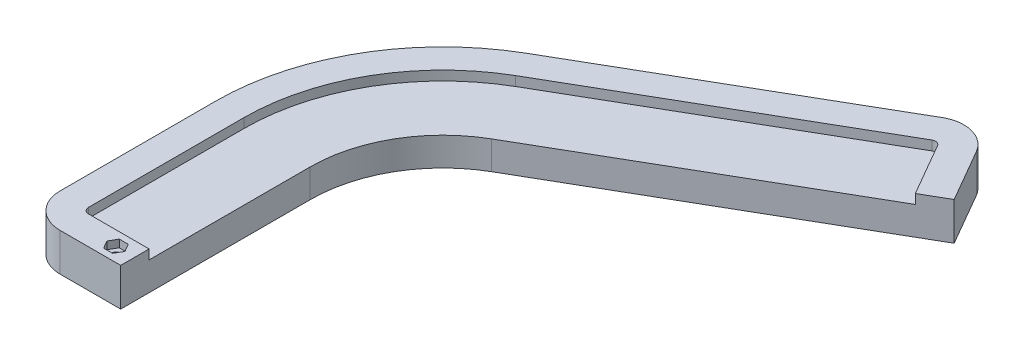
ISO-10303-21;
HEADER;
FILE_DESCRIPTION(('STEP AP214'),'2;1');
FILE_NAME('part.step','',(''),(''),'','','');
FILE_SCHEMA(('AUTOMOTIVE_DESIGN { 1 0 10303 214 1 1 1 1 }'));
ENDSEC;
DATA;
#1=APPLICATION_CONTEXT('core data for automotive mechanical design processes');
#2=APPLICATION_PROTOCOL_DEFINITION('international standard','automotive_design',2000,#1);
#3=PRODUCT_CONTEXT('',#1,'mechanical');
#4=PRODUCT('Part','Part','',(#3));
#5=PRODUCT_RELATED_PRODUCT_CATEGORY('part','',(#4));
#6=PRODUCT_DEFINITION_FORMATION('','',#4);
#7=PRODUCT_DEFINITION_CONTEXT('part definition',#1,'design');
#8=PRODUCT_DEFINITION('design','',#6,#7);
#9=PRODUCT_DEFINITION_SHAPE('','',#8);
#10=(LENGTH_UNIT() NAMED_UNIT(*) SI_UNIT(.MILLI.,.METRE.));
#11=(NAMED_UNIT(*) PLANE_ANGLE_UNIT() SI_UNIT($,.RADIAN.));
#12=(NAMED_UNIT(*) SI_UNIT($,.STERADIAN.) SOLID_ANGLE_UNIT());
#13=UNCERTAINTY_MEASURE_WITH_UNIT(LENGTH_MEASURE(1.E-05),#10,'distance_accuracy_value','');
#14=(GEOMETRIC_REPRESENTATION_CONTEXT(3) GLOBAL_UNCERTAINTY_ASSIGNED_CONTEXT((#13)) GLOBAL_UNIT_ASSIGNED_CONTEXT((#10,
#11,#12)) REPRESENTATION_CONTEXT('',''));
#15=CARTESIAN_POINT('',(0.,0.,0.));
#16=DIRECTION('',(0.,0.,1.));
#17=DIRECTION('',(1.,0.,0.));
#18=AXIS2_PLACEMENT_3D('',#15,#16,#17);
#19=CARTESIAN_POINT('',(0.,20.,0.));
#20=DIRECTION('',(-1.,0.,0.));
#21=DIRECTION('',(0.,0.,1.));
#22=AXIS2_PLACEMENT_3D('',#19,#20,#21);
#23=PLANE('',#22);
#24=DIRECTION('',(0.,0.,-1.));
#25=VECTOR('',#24,1.);
#26=CARTESIAN_POINT('',(0.,15.,-100.));
#27=LINE('',#26,#25);
#28=CARTESIAN_POINT('',(0.,15.,-15.));
#29=VERTEX_POINT('',#28);
#30=CARTESIAN_POINT('',(0.,15.,-100.));
#31=VERTEX_POINT('',#30);
#32=EDGE_CURVE('E251',#29,#31,#27,.T.);
#33=ORIENTED_EDGE('',*,*,#32,.F.);
#34=DIRECTION('',(0.,-1.,0.));
#35=VECTOR('',#34,1.);
#36=CARTESIAN_POINT('',(0.,20.,-15.));
#37=LINE('',#36,#35);
#38=CARTESIAN_POINT('',(0.,20.,-15.));
#39=VERTEX_POINT('',#38);
#40=EDGE_CURVE('E274',#39,#29,#37,.T.);
#41=ORIENTED_EDGE('',*,*,#40,.F.);
#42=DIRECTION('',(0.,0.,-1.));
#43=VECTOR('',#42,1.);
#44=CARTESIAN_POINT('',(0.,20.,0.));
#45=LINE('',#44,#43);
#46=CARTESIAN_POINT('',(0.,20.,0.));
#47=VERTEX_POINT('',#46);
#48=EDGE_CURVE('E326',#47,#39,#45,.T.);
#49=ORIENTED_EDGE('',*,*,#48,.F.);
#50=DIRECTION('',(0.,-1.,0.));
#51=VECTOR('',#50,1.);
#52=CARTESIAN_POINT('',(0.,20.,0.));
#53=LINE('',#52,#51);
#54=CARTESIAN_POINT('',(0.,0.,0.));
#55=VERTEX_POINT('',#54);
#56=EDGE_CURVE('E354',#47,#55,#53,.T.);
#57=ORIENTED_EDGE('',*,*,#56,.T.);
#58=DIRECTION('',(0.,0.,-1.));
#59=VECTOR('',#58,1.);
#60=CARTESIAN_POINT('',(0.,0.,0.));
#61=LINE('',#60,#59);
#62=CARTESIAN_POINT('',(0.,0.,-100.));
#63=VERTEX_POINT('',#62);
#64=EDGE_CURVE('E306',#55,#63,#61,.T.);
#65=ORIENTED_EDGE('',*,*,#64,.T.);
#66=DIRECTION('',(0.,-1.,0.));
#67=VECTOR('',#66,1.);
#68=CARTESIAN_POINT('',(0.,20.,-100.));
#69=LINE('',#68,#67);
#70=EDGE_CURVE('E352',#31,#63,#69,.T.);
#71=ORIENTED_EDGE('',*,*,#70,.F.);
#72=EDGE_LOOP('',(#33,#41,#49,#57,#65,#71));
#73=FACE_BOUND('',#72,.T.);
#74=ADVANCED_FACE('F28',(#73),#23,.F.);
#75=CARTESIAN_POINT('',(70.,20.,-100.));
#76=DIRECTION('',(0.,-1.,0.));
#77=DIRECTION('',(0.,0.,-1.));
#78=AXIS2_PLACEMENT_3D('',#75,#76,#77);
#79=CYLINDRICAL_SURFACE('',#78,70.);
#80=CARTESIAN_POINT('',(70.,15.,-100.));
#81=DIRECTION('',(0.,-1.,0.));
#82=DIRECTION('',(0.,0.,-1.));
#83=AXIS2_PLACEMENT_3D('',#80,#81,#82);
#84=CIRCLE('',#83,70.);
#85=CARTESIAN_POINT('',(35.0000000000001,15.,-160.621778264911));
#86=VERTEX_POINT('',#85);
#87=EDGE_CURVE('E290',#31,#86,#84,.T.);
#88=ORIENTED_EDGE('',*,*,#87,.F.);
#89=ORIENTED_EDGE('',*,*,#70,.T.);
#90=CARTESIAN_POINT('',(70.,0.,-100.));
#91=DIRECTION('',(0.,-1.,0.));
#92=DIRECTION('',(0.,0.,-1.));
#93=AXIS2_PLACEMENT_3D('',#90,#91,#92);
#94=CIRCLE('',#93,70.);
#95=CARTESIAN_POINT('',(35.0000000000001,0.,-160.621778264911));
#96=VERTEX_POINT('',#95);
#97=EDGE_CURVE('E309',#63,#96,#94,.T.);
#98=ORIENTED_EDGE('',*,*,#97,.T.);
#99=DIRECTION('',(0.,-1.,0.));
#100=VECTOR('',#99,1.);
#101=CARTESIAN_POINT('',(35.0000000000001,20.,-160.621778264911));
#102=LINE('',#101,#100);
#103=EDGE_CURVE('E350',#86,#96,#102,.T.);
#104=ORIENTED_EDGE('',*,*,#103,.F.);
#105=EDGE_LOOP('',(#88,#89,#98,#104));
#106=FACE_BOUND('',#105,.T.);
#107=ADVANCED_FACE('F423',(#106),#79,.F.);
#108=CARTESIAN_POINT('',(35.0000000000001,20.,-160.621778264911));
#109=DIRECTION('',(-0.499999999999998,0.,-0.86602540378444));
#110=DIRECTION('',(-0.86602540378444,0.,0.499999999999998));
#111=AXIS2_PLACEMENT_3D('',#108,#109,#110);
#112=PLANE('',#111);
#113=DIRECTION('',(0.86602540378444,0.,-0.499999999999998));
#114=VECTOR('',#113,1.);
#115=CARTESIAN_POINT('',(35.0000000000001,15.,-160.621778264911));
#116=LINE('',#115,#114);
#117=CARTESIAN_POINT('',(176.817240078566,15.,-242.5));
#118=VERTEX_POINT('',#117);
#119=EDGE_CURVE('E262',#86,#118,#116,.T.);
#120=ORIENTED_EDGE('',*,*,#119,.F.);
#121=ORIENTED_EDGE('',*,*,#103,.T.);
#122=DIRECTION('',(0.86602540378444,0.,-0.499999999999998));
#123=VECTOR('',#122,1.);
#124=CARTESIAN_POINT('',(35.0000000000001,0.,-160.621778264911));
#125=LINE('',#124,#123);
#126=CARTESIAN_POINT('',(189.807621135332,0.,-250.));
#127=VERTEX_POINT('',#126);
#128=EDGE_CURVE('E312',#96,#127,#125,.T.);
#129=ORIENTED_EDGE('',*,*,#128,.T.);
#130=DIRECTION('',(0.,-1.,0.));
#131=VECTOR('',#130,1.);
#132=CARTESIAN_POINT('',(189.807621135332,20.,-250.));
#133=LINE('',#132,#131);
#134=CARTESIAN_POINT('',(189.807621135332,20.,-250.));
#135=VERTEX_POINT('',#134);
#136=EDGE_CURVE('E347',#135,#127,#133,.T.);
#137=ORIENTED_EDGE('',*,*,#136,.F.);
#138=DIRECTION('',(0.86602540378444,0.,-0.499999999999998));
#139=VECTOR('',#138,1.);
#140=CARTESIAN_POINT('',(35.0000000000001,20.,-160.621778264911));
#141=LINE('',#140,#139);
#142=CARTESIAN_POINT('',(176.817240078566,20.,-242.5));
#143=VERTEX_POINT('',#142);
#144=EDGE_CURVE('E329',#143,#135,#141,.T.);
#145=ORIENTED_EDGE('',*,*,#144,.F.);
#146=DIRECTION('',(0.,-1.,0.));
#147=VECTOR('',#146,1.);
#148=CARTESIAN_POINT('',(176.817240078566,20.,-242.5));
#149=LINE('',#148,#147);
#150=EDGE_CURVE('E278',#143,#118,#149,.T.);
#151=ORIENTED_EDGE('',*,*,#150,.T.);
#152=EDGE_LOOP('',(#120,#121,#129,#137,#145,#151));
#153=FACE_BOUND('',#152,.T.);
#154=ADVANCED_FACE('F419',(#153),#112,.F.);
#155=CARTESIAN_POINT('',(70.,20.,-100.));
#156=DIRECTION('',(0.,-1.,0.));
#157=DIRECTION('',(0.,0.,-1.));
#158=AXIS2_PLACEMENT_3D('',#155,#156,#157);
#159=PLANE('',#158);
#160=DIRECTION('',(-0.5,0.,0.866025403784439));
#161=VECTOR('',#160,1.);
#162=CARTESIAN_POINT('',(-12.3815698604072,20.0000000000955,-11.625));
#163=LINE('',#162,#161);
#164=CARTESIAN_POINT('',(-12.3815698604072,20.,-11.625));
#165=VERTEX_POINT('',#164);
#166=CARTESIAN_POINT('',(-14.7631397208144,20.0000000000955,-7.49999999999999));
#167=VERTEX_POINT('',#166);
#168=EDGE_CURVE('E204',#165,#167,#163,.T.);
#169=ORIENTED_EDGE('',*,*,#168,.F.);
#170=DIRECTION('',(-1.,0.,0.));
#171=VECTOR('',#170,1.);
#172=CARTESIAN_POINT('',(-7.61843013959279,20.0000000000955,-11.625));
#173=LINE('',#172,#171);
#174=CARTESIAN_POINT('',(-7.61843013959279,20.0000000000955,-11.625));
#175=VERTEX_POINT('',#174);
#176=EDGE_CURVE('E43',#175,#165,#173,.T.);
#177=ORIENTED_EDGE('',*,*,#176,.F.);
#178=DIRECTION('',(-0.5,0.,-0.866025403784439));
#179=VECTOR('',#178,1.);
#180=CARTESIAN_POINT('',(-5.23686027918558,20.0000000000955,-7.49999999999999));
#181=LINE('',#180,#179);
#182=CARTESIAN_POINT('',(-5.23686027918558,20.0000000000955,-7.49999999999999));
#183=VERTEX_POINT('',#182);
#184=EDGE_CURVE('E220',#183,#175,#181,.T.);
#185=ORIENTED_EDGE('',*,*,#184,.F.);
#186=DIRECTION('',(0.5,0.,-0.866025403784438));
#187=VECTOR('',#186,1.);
#188=CARTESIAN_POINT('',(-7.61843013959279,20.0000000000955,-3.37499999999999));
#189=LINE('',#188,#187);
#190=CARTESIAN_POINT('',(-7.61843013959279,20.0000000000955,-3.37499999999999));
#191=VERTEX_POINT('',#190);
#192=EDGE_CURVE('E214',#191,#183,#189,.T.);
#193=ORIENTED_EDGE('',*,*,#192,.F.);
#194=DIRECTION('',(1.,0.,0.));
#195=VECTOR('',#194,1.);
#196=CARTESIAN_POINT('',(-12.3815698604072,20.0000000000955,-3.37499999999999));
#197=LINE('',#196,#195);
#198=CARTESIAN_POINT('',(-12.3815698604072,20.0000000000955,-3.37499999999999));
#199=VERTEX_POINT('',#198);
#200=EDGE_CURVE('E212',#199,#191,#197,.T.);
#201=ORIENTED_EDGE('',*,*,#200,.F.);
#202=DIRECTION('',(0.499999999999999,0.,0.866025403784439));
#203=VECTOR('',#202,1.);
#204=CARTESIAN_POINT('',(-14.7631397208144,20.0000000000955,-7.49999999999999));
#205=LINE('',#204,#203);
#206=EDGE_CURVE('E193',#167,#199,#205,.T.);
#207=ORIENTED_EDGE('',*,*,#206,.F.);
#208=EDGE_LOOP('',(#169,#177,#185,#193,#201,#207));
#209=FACE_BOUND('',#208,.T.);
#210=DIRECTION('',(-0.499999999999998,0.,-0.86602540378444));
#211=VECTOR('',#210,1.);
#212=CARTESIAN_POINT('',(211.817240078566,20.,-181.878221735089));
#213=LINE('',#212,#211);
#214=CARTESIAN_POINT('',(160.817240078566,20.,-270.212812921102));
#215=VERTEX_POINT('',#214);
#216=EDGE_CURVE('E286',#143,#215,#213,.T.);
#217=ORIENTED_EDGE('',*,*,#216,.F.);
#218=ORIENTED_EDGE('',*,*,#144,.T.);
#219=DIRECTION('',(-0.499999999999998,0.,-0.86602540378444));
#220=VECTOR('',#219,1.);
#221=CARTESIAN_POINT('',(164.807621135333,20.,-293.301270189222));
#222=LINE('',#221,#220);
#223=CARTESIAN_POINT('',(173.807621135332,20.,-277.712812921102));
#224=VERTEX_POINT('',#223);
#225=EDGE_CURVE('E331',#135,#224,#222,.T.);
#226=ORIENTED_EDGE('',*,*,#225,.T.);
#227=CARTESIAN_POINT('',(158.219163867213,20.,-268.712812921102));
#228=DIRECTION('',(0.,-1.,0.));
#229=DIRECTION('',(0.,0.,-1.));
#230=AXIS2_PLACEMENT_3D('',#227,#228,#229);
#231=CIRCLE('',#230,18.);
#232=CARTESIAN_POINT('',(149.219163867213,20.,-284.301270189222));
#233=VERTEX_POINT('',#232);
#234=EDGE_CURVE('E368',#224,#233,#231,.F.);
#235=ORIENTED_EDGE('',*,*,#234,.T.);
#236=DIRECTION('',(-0.86602540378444,0.,0.499999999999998));
#237=VECTOR('',#236,1.);
#238=CARTESIAN_POINT('',(10.0000000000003,20.,-203.923048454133));
#239=LINE('',#238,#237);
#240=CARTESIAN_POINT('',(10.0000000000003,20.,-203.923048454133));
#241=VERTEX_POINT('',#240);
#242=EDGE_CURVE('E334',#233,#241,#239,.T.);
#243=ORIENTED_EDGE('',*,*,#242,.T.);
#244=CARTESIAN_POINT('',(70.,20.,-100.));
#245=DIRECTION('',(0.,1.,0.));
#246=DIRECTION('',(0.,0.,-1.));
#247=AXIS2_PLACEMENT_3D('',#244,#245,#246);
#248=CIRCLE('',#247,120.);
#249=CARTESIAN_POINT('',(-50.,20.,-100.));
#250=VERTEX_POINT('',#249);
#251=EDGE_CURVE('E336',#241,#250,#248,.T.);
#252=ORIENTED_EDGE('',*,*,#251,.T.);
#253=DIRECTION('',(0.,0.,1.));
#254=VECTOR('',#253,1.);
#255=CARTESIAN_POINT('',(-50.,20.,0.));
#256=LINE('',#255,#254);
#257=CARTESIAN_POINT('',(-50.,20.,-18.));
#258=VERTEX_POINT('',#257);
#259=EDGE_CURVE('E338',#250,#258,#256,.T.);
#260=ORIENTED_EDGE('',*,*,#259,.T.);
#261=CARTESIAN_POINT('',(-32.,20.,-18.));
#262=DIRECTION('',(0.,-1.,0.));
#263=DIRECTION('',(0.,0.,-1.));
#264=AXIS2_PLACEMENT_3D('',#261,#262,#263);
#265=CIRCLE('',#264,18.);
#266=CARTESIAN_POINT('',(-32.,20.,0.));
#267=VERTEX_POINT('',#266);
#268=EDGE_CURVE('E366',#258,#267,#265,.F.);
#269=ORIENTED_EDGE('',*,*,#268,.T.);
#270=DIRECTION('',(1.,0.,0.));
#271=VECTOR('',#270,1.);
#272=CARTESIAN_POINT('',(-50.,20.,0.));
#273=LINE('',#272,#271);
#274=EDGE_CURVE('E324',#267,#47,#273,.T.);
#275=ORIENTED_EDGE('',*,*,#274,.T.);
#276=ORIENTED_EDGE('',*,*,#48,.T.);
#277=DIRECTION('',(1.,0.,0.));
#278=VECTOR('',#277,1.);
#279=CARTESIAN_POINT('',(70.,20.,-15.));
#280=LINE('',#279,#278);
#281=CARTESIAN_POINT('',(-32.,20.,-15.));
#282=VERTEX_POINT('',#281);
#283=EDGE_CURVE('E268',#282,#39,#280,.T.);
#284=ORIENTED_EDGE('',*,*,#283,.F.);
#285=CARTESIAN_POINT('',(-32.,20.,-18.));
#286=DIRECTION('',(0.,-1.,0.));
#287=DIRECTION('',(0.,0.,-1.));
#288=AXIS2_PLACEMENT_3D('',#285,#286,#287);
#289=CIRCLE('',#288,3.);
#290=CARTESIAN_POINT('',(-35.,20.,-18.));
#291=VERTEX_POINT('',#290);
#292=EDGE_CURVE('E271',#291,#282,#289,.F.);
#293=ORIENTED_EDGE('',*,*,#292,.F.);
#294=DIRECTION('',(0.,0.,1.));
#295=VECTOR('',#294,1.);
#296=CARTESIAN_POINT('',(-35.,20.,-100.));
#297=LINE('',#296,#295);
#298=CARTESIAN_POINT('',(-35.,20.,-100.));
#299=VERTEX_POINT('',#298);
#300=EDGE_CURVE('E282',#299,#291,#297,.T.);
#301=ORIENTED_EDGE('',*,*,#300,.F.);
#302=CARTESIAN_POINT('',(70.,20.,-100.));
#303=DIRECTION('',(0.,-1.,0.));
#304=DIRECTION('',(0.,0.,-1.));
#305=AXIS2_PLACEMENT_3D('',#302,#303,#304);
#306=CIRCLE('',#305,105.);
#307=CARTESIAN_POINT('',(17.5000000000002,20.,-190.932667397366));
#308=VERTEX_POINT('',#307);
#309=EDGE_CURVE('E300',#308,#299,#306,.F.);
#310=ORIENTED_EDGE('',*,*,#309,.F.);
#311=DIRECTION('',(-0.86602540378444,0.,0.499999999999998));
#312=VECTOR('',#311,1.);
#313=CARTESIAN_POINT('',(17.5000000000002,20.,-190.932667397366));
#314=LINE('',#313,#312);
#315=CARTESIAN_POINT('',(156.719163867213,20.,-271.310889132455));
#316=VERTEX_POINT('',#315);
#317=EDGE_CURVE('E297',#316,#308,#314,.T.);
#318=ORIENTED_EDGE('',*,*,#317,.F.);
#319=CARTESIAN_POINT('',(158.219163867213,20.,-268.712812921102));
#320=DIRECTION('',(0.,-1.,0.));
#321=DIRECTION('',(0.,0.,-1.));
#322=AXIS2_PLACEMENT_3D('',#319,#320,#321);
#323=CIRCLE('',#322,3.);
#324=EDGE_CURVE('E249',#215,#316,#323,.F.);
#325=ORIENTED_EDGE('',*,*,#324,.F.);
#326=EDGE_LOOP('',(#217,#218,#226,#235,#243,#252,#260,#269,#275,#276,#284,#293,#301,#310,#318,#325));
#327=FACE_BOUND('',#326,.T.);
#328=ADVANCED_FACE('F208',(#209,#327),#159,.F.);
#329=CARTESIAN_POINT('',(-50.,20.,0.));
#330=DIRECTION('',(0.,0.,-1.));
#331=DIRECTION('',(-1.,0.,0.));
#332=AXIS2_PLACEMENT_3D('',#329,#330,#331);
#333=PLANE('',#332);
#334=ORIENTED_EDGE('',*,*,#274,.F.);
#335=DIRECTION('',(0.,-1.,0.));
#336=VECTOR('',#335,1.);
#337=CARTESIAN_POINT('',(-32.,20.,0.));
#338=LINE('',#337,#336);
#339=CARTESIAN_POINT('',(-32.,0.,0.));
#340=VERTEX_POINT('',#339);
#341=EDGE_CURVE('E36',#267,#340,#338,.T.);
#342=ORIENTED_EDGE('',*,*,#341,.T.);
#343=DIRECTION('',(1.,0.,0.));
#344=VECTOR('',#343,1.);
#345=CARTESIAN_POINT('',(-50.,0.,0.));
#346=LINE('',#345,#344);
#347=EDGE_CURVE('E284',#340,#55,#346,.T.);
#348=ORIENTED_EDGE('',*,*,#347,.T.);
#349=ORIENTED_EDGE('',*,*,#56,.F.);
#350=EDGE_LOOP('',(#334,#342,#348,#349));
#351=FACE_BOUND('',#350,.T.);
#352=ADVANCED_FACE('F30',(#351),#333,.F.);
#353=CARTESIAN_POINT('',(164.807621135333,20.,-293.301270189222));
#354=DIRECTION('',(-0.86602540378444,0.,0.499999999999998));
#355=DIRECTION('',(0.499999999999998,0.,0.86602540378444));
#356=AXIS2_PLACEMENT_3D('',#353,#354,#355);
#357=PLANE('',#356);
#358=DIRECTION('',(-0.499999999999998,0.,-0.86602540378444));
#359=VECTOR('',#358,1.);
#360=CARTESIAN_POINT('',(164.807621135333,0.,-293.301270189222));
#361=LINE('',#360,#359);
#362=CARTESIAN_POINT('',(173.807621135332,0.,-277.712812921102));
#363=VERTEX_POINT('',#362);
#364=EDGE_CURVE('E314',#127,#363,#361,.T.);
#365=ORIENTED_EDGE('',*,*,#364,.T.);
#366=DIRECTION('',(0.,-1.,0.));
#367=VECTOR('',#366,1.);
#368=CARTESIAN_POINT('',(173.807621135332,20.,-277.712812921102));
#369=LINE('',#368,#367);
#370=EDGE_CURVE('E364',#363,#224,#369,.F.);
#371=ORIENTED_EDGE('',*,*,#370,.T.);
#372=ORIENTED_EDGE('',*,*,#225,.F.);
#373=ORIENTED_EDGE('',*,*,#136,.T.);
#374=EDGE_LOOP('',(#365,#371,#372,#373));
#375=FACE_BOUND('',#374,.T.);
#376=ADVANCED_FACE('F413',(#375),#357,.F.);
#377=CARTESIAN_POINT('',(10.0000000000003,20.,-203.923048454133));
#378=DIRECTION('',(0.499999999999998,0.,0.86602540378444));
#379=DIRECTION('',(0.86602540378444,0.,-0.499999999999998));
#380=AXIS2_PLACEMENT_3D('',#377,#378,#379);
#381=PLANE('',#380);
#382=ORIENTED_EDGE('',*,*,#242,.F.);
#383=DIRECTION('',(0.,-1.,0.));
#384=VECTOR('',#383,1.);
#385=CARTESIAN_POINT('',(149.219163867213,20.,-284.301270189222));
#386=LINE('',#385,#384);
#387=CARTESIAN_POINT('',(149.219163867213,0.,-284.301270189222));
#388=VERTEX_POINT('',#387);
#389=EDGE_CURVE('E357',#233,#388,#386,.T.);
#390=ORIENTED_EDGE('',*,*,#389,.T.);
#391=DIRECTION('',(-0.86602540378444,0.,0.499999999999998));
#392=VECTOR('',#391,1.);
#393=CARTESIAN_POINT('',(10.0000000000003,0.,-203.923048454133));
#394=LINE('',#393,#392);
#395=CARTESIAN_POINT('',(10.0000000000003,0.,-203.923048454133));
#396=VERTEX_POINT('',#395);
#397=EDGE_CURVE('E317',#388,#396,#394,.T.);
#398=ORIENTED_EDGE('',*,*,#397,.T.);
#399=DIRECTION('',(0.,-1.,0.));
#400=VECTOR('',#399,1.);
#401=CARTESIAN_POINT('',(10.0000000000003,20.,-203.923048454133));
#402=LINE('',#401,#400);
#403=EDGE_CURVE('E344',#241,#396,#402,.T.);
#404=ORIENTED_EDGE('',*,*,#403,.F.);
#405=EDGE_LOOP('',(#382,#390,#398,#404));
#406=FACE_BOUND('',#405,.T.);
#407=ADVANCED_FACE('F405',(#406),#381,.F.);
#408=CARTESIAN_POINT('',(70.,20.,-100.));
#409=DIRECTION('',(0.,-1.,0.));
#410=DIRECTION('',(0.,0.,-1.));
#411=AXIS2_PLACEMENT_3D('',#408,#409,#410);
#412=CYLINDRICAL_SURFACE('',#411,120.);
#413=CARTESIAN_POINT('',(70.,0.,-100.));
#414=DIRECTION('',(0.,1.,0.));
#415=DIRECTION('',(0.,0.,-1.));
#416=AXIS2_PLACEMENT_3D('',#413,#414,#415);
#417=CIRCLE('',#416,120.);
#418=CARTESIAN_POINT('',(-50.,0.,-100.));
#419=VERTEX_POINT('',#418);
#420=EDGE_CURVE('E319',#396,#419,#417,.T.);
#421=ORIENTED_EDGE('',*,*,#420,.T.);
#422=DIRECTION('',(0.,-1.,0.));
#423=VECTOR('',#422,1.);
#424=CARTESIAN_POINT('',(-50.,20.,-100.));
#425=LINE('',#424,#423);
#426=EDGE_CURVE('E341',#250,#419,#425,.T.);
#427=ORIENTED_EDGE('',*,*,#426,.F.);
#428=ORIENTED_EDGE('',*,*,#251,.F.);
#429=ORIENTED_EDGE('',*,*,#403,.T.);
#430=EDGE_LOOP('',(#421,#427,#428,#429));
#431=FACE_BOUND('',#430,.T.);
#432=ADVANCED_FACE('F400',(#431),#412,.T.);
#433=CARTESIAN_POINT('',(-50.,20.,0.));
#434=DIRECTION('',(1.,0.,0.));
#435=DIRECTION('',(0.,0.,-1.));
#436=AXIS2_PLACEMENT_3D('',#433,#434,#435);
#437=PLANE('',#436);
#438=DIRECTION('',(0.,0.,1.));
#439=VECTOR('',#438,1.);
#440=CARTESIAN_POINT('',(-50.,0.,0.));
#441=LINE('',#440,#439);
#442=CARTESIAN_POINT('',(-50.,0.,-18.));
#443=VERTEX_POINT('',#442);
#444=EDGE_CURVE('E321',#419,#443,#441,.T.);
#445=ORIENTED_EDGE('',*,*,#444,.T.);
#446=DIRECTION('',(0.,-1.,0.));
#447=VECTOR('',#446,1.);
#448=CARTESIAN_POINT('',(-50.,20.,-18.));
#449=LINE('',#448,#447);
#450=EDGE_CURVE('E11',#443,#258,#449,.F.);
#451=ORIENTED_EDGE('',*,*,#450,.T.);
#452=ORIENTED_EDGE('',*,*,#259,.F.);
#453=ORIENTED_EDGE('',*,*,#426,.T.);
#454=EDGE_LOOP('',(#445,#451,#452,#453));
#455=FACE_BOUND('',#454,.T.);
#456=ADVANCED_FACE('F396',(#455),#437,.F.);
#457=CARTESIAN_POINT('',(70.,0.,-100.));
#458=DIRECTION('',(0.,-1.,0.));
#459=DIRECTION('',(0.,0.,-1.));
#460=AXIS2_PLACEMENT_3D('',#457,#458,#459);
#461=PLANE('',#460);
#462=CARTESIAN_POINT('',(-9.99999999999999,0.,-7.5));
#463=DIRECTION('',(0.,1.,0.));
#464=DIRECTION('',(0.,0.,1.));
#465=AXIS2_PLACEMENT_3D('',#462,#463,#464);
#466=CIRCLE('',#465,2.00000000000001);
#467=CARTESIAN_POINT('',(-9.99999999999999,0.,-5.49999999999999));
#468=VERTEX_POINT('',#467);
#469=EDGE_CURVE('E594',#468,#468,#466,.T.);
#470=ORIENTED_EDGE('',*,*,#469,.T.);
#471=EDGE_LOOP('',(#470));
#472=FACE_BOUND('',#471,.T.);
#473=ORIENTED_EDGE('',*,*,#397,.F.);
#474=CARTESIAN_POINT('',(158.219163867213,0.,-268.712812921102));
#475=DIRECTION('',(0.,-1.,0.));
#476=DIRECTION('',(0.,0.,-1.));
#477=AXIS2_PLACEMENT_3D('',#474,#475,#476);
#478=CIRCLE('',#477,18.);
#479=EDGE_CURVE('E362',#388,#363,#478,.T.);
#480=ORIENTED_EDGE('',*,*,#479,.T.);
#481=ORIENTED_EDGE('',*,*,#364,.F.);
#482=ORIENTED_EDGE('',*,*,#128,.F.);
#483=ORIENTED_EDGE('',*,*,#97,.F.);
#484=ORIENTED_EDGE('',*,*,#64,.F.);
#485=ORIENTED_EDGE('',*,*,#347,.F.);
#486=CARTESIAN_POINT('',(-32.,0.,-18.));
#487=DIRECTION('',(0.,-1.,0.));
#488=DIRECTION('',(0.,0.,-1.));
#489=AXIS2_PLACEMENT_3D('',#486,#487,#488);
#490=CIRCLE('',#489,18.);
#491=EDGE_CURVE('E360',#340,#443,#490,.T.);
#492=ORIENTED_EDGE('',*,*,#491,.T.);
#493=ORIENTED_EDGE('',*,*,#444,.F.);
#494=ORIENTED_EDGE('',*,*,#420,.F.);
#495=EDGE_LOOP('',(#473,#480,#481,#482,#483,#484,#485,#492,#493,#494));
#496=FACE_BOUND('',#495,.T.);
#497=ADVANCED_FACE('F380',(#472,#496),#461,.T.);
#498=CARTESIAN_POINT('',(158.219163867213,20.,-268.712812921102));
#499=DIRECTION('',(0.,-1.,0.));
#500=DIRECTION('',(0.,0.,-1.));
#501=AXIS2_PLACEMENT_3D('',#498,#499,#500);
#502=CYLINDRICAL_SURFACE('',#501,18.);
#503=ORIENTED_EDGE('',*,*,#234,.F.);
#504=ORIENTED_EDGE('',*,*,#370,.F.);
#505=ORIENTED_EDGE('',*,*,#479,.F.);
#506=ORIENTED_EDGE('',*,*,#389,.F.);
#507=EDGE_LOOP('',(#503,#504,#505,#506));
#508=FACE_BOUND('',#507,.T.);
#509=ADVANCED_FACE('F409',(#508),#502,.T.);
#510=CARTESIAN_POINT('',(-32.,20.,-18.));
#511=DIRECTION('',(0.,-1.,0.));
#512=DIRECTION('',(0.,0.,-1.));
#513=AXIS2_PLACEMENT_3D('',#510,#511,#512);
#514=CYLINDRICAL_SURFACE('',#513,18.);
#515=ORIENTED_EDGE('',*,*,#268,.F.);
#516=ORIENTED_EDGE('',*,*,#450,.F.);
#517=ORIENTED_EDGE('',*,*,#491,.F.);
#518=ORIENTED_EDGE('',*,*,#341,.F.);
#519=EDGE_LOOP('',(#515,#516,#517,#518));
#520=FACE_BOUND('',#519,.T.);
#521=ADVANCED_FACE('F394',(#520),#514,.T.);
#522=CARTESIAN_POINT('',(-50.,20.,-15.));
#523=DIRECTION('',(0.,0.,-1.));
#524=DIRECTION('',(-1.,0.,0.));
#525=AXIS2_PLACEMENT_3D('',#522,#523,#524);
#526=PLANE('',#525);
#527=ORIENTED_EDGE('',*,*,#283,.T.);
#528=ORIENTED_EDGE('',*,*,#40,.T.);
#529=DIRECTION('',(1.,0.,0.));
#530=VECTOR('',#529,1.);
#531=CARTESIAN_POINT('',(70.,15.,-15.));
#532=LINE('',#531,#530);
#533=CARTESIAN_POINT('',(-32.,15.,-15.));
#534=VERTEX_POINT('',#533);
#535=EDGE_CURVE('E240',#534,#29,#532,.T.);
#536=ORIENTED_EDGE('',*,*,#535,.F.);
#537=DIRECTION('',(0.,1.,0.));
#538=VECTOR('',#537,1.);
#539=CARTESIAN_POINT('',(-32.,20.,-15.));
#540=LINE('',#539,#538);
#541=EDGE_CURVE('E51',#282,#534,#540,.F.);
#542=ORIENTED_EDGE('',*,*,#541,.F.);
#543=EDGE_LOOP('',(#527,#528,#536,#542));
#544=FACE_BOUND('',#543,.T.);
#545=ADVANCED_FACE('F426',(#544),#526,.T.);
#546=CARTESIAN_POINT('',(151.817240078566,20.,-285.801270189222));
#547=DIRECTION('',(-0.86602540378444,0.,0.499999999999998));
#548=DIRECTION('',(0.499999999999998,0.,0.86602540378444));
#549=AXIS2_PLACEMENT_3D('',#546,#547,#548);
#550=PLANE('',#549);
#551=DIRECTION('',(-0.499999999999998,0.,-0.86602540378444));
#552=VECTOR('',#551,1.);
#553=CARTESIAN_POINT('',(211.817240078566,15.,-181.878221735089));
#554=LINE('',#553,#552);
#555=CARTESIAN_POINT('',(160.817240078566,15.,-270.212812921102));
#556=VERTEX_POINT('',#555);
#557=EDGE_CURVE('E255',#118,#556,#554,.T.);
#558=ORIENTED_EDGE('',*,*,#557,.F.);
#559=ORIENTED_EDGE('',*,*,#150,.F.);
#560=ORIENTED_EDGE('',*,*,#216,.T.);
#561=DIRECTION('',(0.,1.,0.));
#562=VECTOR('',#561,1.);
#563=CARTESIAN_POINT('',(160.817240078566,20.,-270.212812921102));
#564=LINE('',#563,#562);
#565=EDGE_CURVE('E258',#556,#215,#564,.T.);
#566=ORIENTED_EDGE('',*,*,#565,.F.);
#567=EDGE_LOOP('',(#558,#559,#560,#566));
#568=FACE_BOUND('',#567,.T.);
#569=ADVANCED_FACE('F428',(#568),#550,.T.);
#570=CARTESIAN_POINT('',(17.5000000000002,20.,-190.932667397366));
#571=DIRECTION('',(0.499999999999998,0.,0.86602540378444));
#572=DIRECTION('',(0.86602540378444,0.,-0.499999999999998));
#573=AXIS2_PLACEMENT_3D('',#570,#571,#572);
#574=PLANE('',#573);
#575=ORIENTED_EDGE('',*,*,#317,.T.);
#576=DIRECTION('',(0.,-1.,0.));
#577=VECTOR('',#576,1.);
#578=CARTESIAN_POINT('',(17.5000000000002,20.,-190.932667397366));
#579=LINE('',#578,#577);
#580=CARTESIAN_POINT('',(17.5000000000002,15.,-190.932667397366));
#581=VERTEX_POINT('',#580);
#582=EDGE_CURVE('E275',#308,#581,#579,.T.);
#583=ORIENTED_EDGE('',*,*,#582,.T.);
#584=DIRECTION('',(-0.86602540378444,0.,0.499999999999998));
#585=VECTOR('',#584,1.);
#586=CARTESIAN_POINT('',(17.5000000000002,15.,-190.932667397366));
#587=LINE('',#586,#585);
#588=CARTESIAN_POINT('',(156.719163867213,15.,-271.310889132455));
#589=VERTEX_POINT('',#588);
#590=EDGE_CURVE('E252',#589,#581,#587,.T.);
#591=ORIENTED_EDGE('',*,*,#590,.F.);
#592=DIRECTION('',(0.,1.,0.));
#593=VECTOR('',#592,1.);
#594=CARTESIAN_POINT('',(156.719163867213,20.,-271.310889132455));
#595=LINE('',#594,#593);
#596=EDGE_CURVE('E264',#316,#589,#595,.F.);
#597=ORIENTED_EDGE('',*,*,#596,.F.);
#598=EDGE_LOOP('',(#575,#583,#591,#597));
#599=FACE_BOUND('',#598,.T.);
#600=ADVANCED_FACE('F434',(#599),#574,.T.);
#601=CARTESIAN_POINT('',(70.,20.,-100.));
#602=DIRECTION('',(0.,-1.,0.));
#603=DIRECTION('',(0.,0.,-1.));
#604=AXIS2_PLACEMENT_3D('',#601,#602,#603);
#605=CYLINDRICAL_SURFACE('',#604,105.);
#606=CARTESIAN_POINT('',(70.,15.,-100.));
#607=DIRECTION('',(0.,-1.,0.));
#608=DIRECTION('',(0.,0.,-1.));
#609=AXIS2_PLACEMENT_3D('',#606,#607,#608);
#610=CIRCLE('',#609,105.);
#611=CARTESIAN_POINT('',(-35.,15.,-100.));
#612=VERTEX_POINT('',#611);
#613=EDGE_CURVE('E254',#581,#612,#610,.F.);
#614=ORIENTED_EDGE('',*,*,#613,.F.);
#615=ORIENTED_EDGE('',*,*,#582,.F.);
#616=ORIENTED_EDGE('',*,*,#309,.T.);
#617=DIRECTION('',(0.,1.,0.));
#618=VECTOR('',#617,1.);
#619=CARTESIAN_POINT('',(-35.,20.,-100.));
#620=LINE('',#619,#618);
#621=EDGE_CURVE('E279',#299,#612,#620,.F.);
#622=ORIENTED_EDGE('',*,*,#621,.T.);
#623=EDGE_LOOP('',(#614,#615,#616,#622));
#624=FACE_BOUND('',#623,.T.);
#625=ADVANCED_FACE('F476',(#624),#605,.F.);
#626=CARTESIAN_POINT('',(-35.,20.,0.));
#627=DIRECTION('',(1.,0.,0.));
#628=DIRECTION('',(0.,0.,-1.));
#629=AXIS2_PLACEMENT_3D('',#626,#627,#628);
#630=PLANE('',#629);
#631=DIRECTION('',(0.,0.,1.));
#632=VECTOR('',#631,1.);
#633=CARTESIAN_POINT('',(-35.,15.,-100.));
#634=LINE('',#633,#632);
#635=CARTESIAN_POINT('',(-35.,15.,-18.));
#636=VERTEX_POINT('',#635);
#637=EDGE_CURVE('E265',#612,#636,#634,.T.);
#638=ORIENTED_EDGE('',*,*,#637,.F.);
#639=ORIENTED_EDGE('',*,*,#621,.F.);
#640=ORIENTED_EDGE('',*,*,#300,.T.);
#641=DIRECTION('',(0.,1.,0.));
#642=VECTOR('',#641,1.);
#643=CARTESIAN_POINT('',(-35.,20.,-18.));
#644=LINE('',#643,#642);
#645=EDGE_CURVE('E248',#636,#291,#644,.T.);
#646=ORIENTED_EDGE('',*,*,#645,.F.);
#647=EDGE_LOOP('',(#638,#639,#640,#646));
#648=FACE_BOUND('',#647,.T.);
#649=ADVANCED_FACE('F473',(#648),#630,.T.);
#650=CARTESIAN_POINT('',(70.,15.,-100.));
#651=DIRECTION('',(0.,-1.,0.));
#652=DIRECTION('',(0.,0.,-1.));
#653=AXIS2_PLACEMENT_3D('',#650,#651,#652);
#654=PLANE('',#653);
#655=ORIENTED_EDGE('',*,*,#590,.T.);
#656=ORIENTED_EDGE('',*,*,#613,.T.);
#657=ORIENTED_EDGE('',*,*,#637,.T.);
#658=CARTESIAN_POINT('',(-32.,15.,-18.));
#659=DIRECTION('',(0.,-1.,0.));
#660=DIRECTION('',(0.,0.,-1.));
#661=AXIS2_PLACEMENT_3D('',#658,#659,#660);
#662=CIRCLE('',#661,3.);
#663=EDGE_CURVE('E259',#534,#636,#662,.T.);
#664=ORIENTED_EDGE('',*,*,#663,.F.);
#665=ORIENTED_EDGE('',*,*,#535,.T.);
#666=ORIENTED_EDGE('',*,*,#32,.T.);
#667=ORIENTED_EDGE('',*,*,#87,.T.);
#668=ORIENTED_EDGE('',*,*,#119,.T.);
#669=ORIENTED_EDGE('',*,*,#557,.T.);
#670=CARTESIAN_POINT('',(158.219163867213,15.,-268.712812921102));
#671=DIRECTION('',(0.,-1.,0.));
#672=DIRECTION('',(0.,0.,-1.));
#673=AXIS2_PLACEMENT_3D('',#670,#671,#672);
#674=CIRCLE('',#673,3.);
#675=EDGE_CURVE('E256',#589,#556,#674,.T.);
#676=ORIENTED_EDGE('',*,*,#675,.F.);
#677=EDGE_LOOP('',(#655,#656,#657,#664,#665,#666,#667,#668,#669,#676));
#678=FACE_BOUND('',#677,.T.);
#679=ADVANCED_FACE('F425',(#678),#654,.F.);
#680=CARTESIAN_POINT('',(158.219163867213,20.,-268.712812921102));
#681=DIRECTION('',(0.,-1.,0.));
#682=DIRECTION('',(0.,0.,-1.));
#683=AXIS2_PLACEMENT_3D('',#680,#681,#682);
#684=CYLINDRICAL_SURFACE('',#683,3.);
#685=ORIENTED_EDGE('',*,*,#324,.T.);
#686=ORIENTED_EDGE('',*,*,#596,.T.);
#687=ORIENTED_EDGE('',*,*,#675,.T.);
#688=ORIENTED_EDGE('',*,*,#565,.T.);
#689=EDGE_LOOP('',(#685,#686,#687,#688));
#690=FACE_BOUND('',#689,.T.);
#691=ADVANCED_FACE('F466',(#690),#684,.F.);
#692=CARTESIAN_POINT('',(-32.,20.,-18.));
#693=DIRECTION('',(0.,-1.,0.));
#694=DIRECTION('',(0.,0.,-1.));
#695=AXIS2_PLACEMENT_3D('',#692,#693,#694);
#696=CYLINDRICAL_SURFACE('',#695,3.);
#697=ORIENTED_EDGE('',*,*,#292,.T.);
#698=ORIENTED_EDGE('',*,*,#541,.T.);
#699=ORIENTED_EDGE('',*,*,#663,.T.);
#700=ORIENTED_EDGE('',*,*,#645,.T.);
#701=EDGE_LOOP('',(#697,#698,#699,#700));
#702=FACE_BOUND('',#701,.T.);
#703=ADVANCED_FACE('F462',(#702),#696,.F.);
#704=CARTESIAN_POINT('',(-7.61843013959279,16.0000000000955,-11.625));
#705=DIRECTION('',(0.,0.,-1.));
#706=DIRECTION('',(-1.,0.,0.));
#707=AXIS2_PLACEMENT_3D('',#704,#705,#706);
#708=PLANE('',#707);
#709=ORIENTED_EDGE('',*,*,#176,.T.);
#710=DIRECTION('',(0.,1.,0.));
#711=VECTOR('',#710,1.);
#712=CARTESIAN_POINT('',(-12.3815698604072,16.0000000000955,-11.625));
#713=LINE('',#712,#711);
#714=CARTESIAN_POINT('',(-12.3815698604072,16.0000000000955,-11.625));
#715=VERTEX_POINT('',#714);
#716=EDGE_CURVE('E201',#715,#165,#713,.T.);
#717=ORIENTED_EDGE('',*,*,#716,.F.);
#718=DIRECTION('',(-1.,0.,0.));
#719=VECTOR('',#718,1.);
#720=CARTESIAN_POINT('',(-7.61843013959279,16.0000000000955,-11.625));
#721=LINE('',#720,#719);
#722=CARTESIAN_POINT('',(-7.61843013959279,16.0000000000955,-11.625));
#723=VERTEX_POINT('',#722);
#724=EDGE_CURVE('E223',#723,#715,#721,.T.);
#725=ORIENTED_EDGE('',*,*,#724,.F.);
#726=DIRECTION('',(0.,1.,0.));
#727=VECTOR('',#726,1.);
#728=CARTESIAN_POINT('',(-7.61843013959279,16.0000000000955,-11.625));
#729=LINE('',#728,#727);
#730=EDGE_CURVE('E238',#723,#175,#729,.T.);
#731=ORIENTED_EDGE('',*,*,#730,.T.);
#732=EDGE_LOOP('',(#709,#717,#725,#731));
#733=FACE_BOUND('',#732,.T.);
#734=ADVANCED_FACE('F465',(#733),#708,.F.);
#735=CARTESIAN_POINT('',(-5.23686027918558,16.0000000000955,-7.49999999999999));
#736=DIRECTION('',(0.866025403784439,0.,-0.5));
#737=DIRECTION('',(-0.5,0.,-0.866025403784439));
#738=AXIS2_PLACEMENT_3D('',#735,#736,#737);
#739=PLANE('',#738);
#740=ORIENTED_EDGE('',*,*,#184,.T.);
#741=ORIENTED_EDGE('',*,*,#730,.F.);
#742=DIRECTION('',(-0.5,0.,-0.866025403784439));
#743=VECTOR('',#742,1.);
#744=CARTESIAN_POINT('',(-5.23686027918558,16.0000000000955,-7.49999999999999));
#745=LINE('',#744,#743);
#746=CARTESIAN_POINT('',(-5.23686027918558,16.0000000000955,-7.49999999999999));
#747=VERTEX_POINT('',#746);
#748=EDGE_CURVE('E235',#747,#723,#745,.T.);
#749=ORIENTED_EDGE('',*,*,#748,.F.);
#750=DIRECTION('',(0.,1.,0.));
#751=VECTOR('',#750,1.);
#752=CARTESIAN_POINT('',(-5.23686027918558,16.0000000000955,-7.49999999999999));
#753=LINE('',#752,#751);
#754=EDGE_CURVE('E241',#747,#183,#753,.T.);
#755=ORIENTED_EDGE('',*,*,#754,.T.);
#756=EDGE_LOOP('',(#740,#741,#749,#755));
#757=FACE_BOUND('',#756,.T.);
#758=ADVANCED_FACE('F532',(#757),#739,.F.);
#759=CARTESIAN_POINT('',(-7.61843013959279,16.0000000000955,-3.37499999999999));
#760=DIRECTION('',(0.866025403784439,0.,0.5));
#761=DIRECTION('',(0.5,0.,-0.866025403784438));
#762=AXIS2_PLACEMENT_3D('',#759,#760,#761);
#763=PLANE('',#762);
#764=ORIENTED_EDGE('',*,*,#192,.T.);
#765=ORIENTED_EDGE('',*,*,#754,.F.);
#766=DIRECTION('',(0.5,0.,-0.866025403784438));
#767=VECTOR('',#766,1.);
#768=CARTESIAN_POINT('',(-7.61843013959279,16.0000000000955,-3.37499999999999));
#769=LINE('',#768,#767);
#770=CARTESIAN_POINT('',(-7.61843013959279,16.0000000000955,-3.37499999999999));
#771=VERTEX_POINT('',#770);
#772=EDGE_CURVE('E232',#771,#747,#769,.T.);
#773=ORIENTED_EDGE('',*,*,#772,.F.);
#774=DIRECTION('',(0.,1.,0.));
#775=VECTOR('',#774,1.);
#776=CARTESIAN_POINT('',(-7.61843013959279,16.0000000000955,-3.37499999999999));
#777=LINE('',#776,#775);
#778=EDGE_CURVE('E243',#771,#191,#777,.T.);
#779=ORIENTED_EDGE('',*,*,#778,.T.);
#780=EDGE_LOOP('',(#764,#765,#773,#779));
#781=FACE_BOUND('',#780,.T.);
#782=ADVANCED_FACE('F538',(#781),#763,.F.);
#783=CARTESIAN_POINT('',(-12.3815698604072,16.0000000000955,-3.37499999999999));
#784=DIRECTION('',(0.,0.,1.));
#785=DIRECTION('',(1.,0.,0.));
#786=AXIS2_PLACEMENT_3D('',#783,#784,#785);
#787=PLANE('',#786);
#788=ORIENTED_EDGE('',*,*,#200,.T.);
#789=ORIENTED_EDGE('',*,*,#778,.F.);
#790=DIRECTION('',(1.,0.,0.));
#791=VECTOR('',#790,1.);
#792=CARTESIAN_POINT('',(-12.3815698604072,16.0000000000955,-3.37499999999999));
#793=LINE('',#792,#791);
#794=CARTESIAN_POINT('',(-12.3815698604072,16.0000000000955,-3.37499999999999));
#795=VERTEX_POINT('',#794);
#796=EDGE_CURVE('E229',#795,#771,#793,.T.);
#797=ORIENTED_EDGE('',*,*,#796,.F.);
#798=DIRECTION('',(0.,1.,0.));
#799=VECTOR('',#798,1.);
#800=CARTESIAN_POINT('',(-12.3815698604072,16.0000000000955,-3.37499999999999));
#801=LINE('',#800,#799);
#802=EDGE_CURVE('E200',#795,#199,#801,.T.);
#803=ORIENTED_EDGE('',*,*,#802,.T.);
#804=EDGE_LOOP('',(#788,#789,#797,#803));
#805=FACE_BOUND('',#804,.T.);
#806=ADVANCED_FACE('F546',(#805),#787,.F.);
#807=CARTESIAN_POINT('',(-14.7631397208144,16.0000000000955,-7.49999999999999));
#808=DIRECTION('',(-0.866025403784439,0.,0.5));
#809=DIRECTION('',(0.499999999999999,0.,0.866025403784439));
#810=AXIS2_PLACEMENT_3D('',#807,#808,#809);
#811=PLANE('',#810);
#812=ORIENTED_EDGE('',*,*,#206,.T.);
#813=ORIENTED_EDGE('',*,*,#802,.F.);
#814=DIRECTION('',(0.499999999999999,0.,0.866025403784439));
#815=VECTOR('',#814,1.);
#816=CARTESIAN_POINT('',(-14.7631397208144,16.0000000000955,-7.49999999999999));
#817=LINE('',#816,#815);
#818=CARTESIAN_POINT('',(-14.7631397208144,16.0000000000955,-7.49999999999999));
#819=VERTEX_POINT('',#818);
#820=EDGE_CURVE('E196',#819,#795,#817,.T.);
#821=ORIENTED_EDGE('',*,*,#820,.F.);
#822=DIRECTION('',(0.,1.,0.));
#823=VECTOR('',#822,1.);
#824=CARTESIAN_POINT('',(-14.7631397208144,16.0000000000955,-7.49999999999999));
#825=LINE('',#824,#823);
#826=EDGE_CURVE('E189',#819,#167,#825,.T.);
#827=ORIENTED_EDGE('',*,*,#826,.T.);
#828=EDGE_LOOP('',(#812,#813,#821,#827));
#829=FACE_BOUND('',#828,.T.);
#830=ADVANCED_FACE('F191',(#829),#811,.F.);
#831=CARTESIAN_POINT('',(-12.3815698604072,16.0000000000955,-11.625));
#832=DIRECTION('',(-0.866025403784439,0.,-0.5));
#833=DIRECTION('',(-0.5,0.,0.866025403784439));
#834=AXIS2_PLACEMENT_3D('',#831,#832,#833);
#835=PLANE('',#834);
#836=ORIENTED_EDGE('',*,*,#168,.T.);
#837=ORIENTED_EDGE('',*,*,#826,.F.);
#838=DIRECTION('',(-0.5,0.,0.866025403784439));
#839=VECTOR('',#838,1.);
#840=CARTESIAN_POINT('',(-12.3815698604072,16.0000000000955,-11.625));
#841=LINE('',#840,#839);
#842=EDGE_CURVE('E226',#715,#819,#841,.T.);
#843=ORIENTED_EDGE('',*,*,#842,.F.);
#844=ORIENTED_EDGE('',*,*,#716,.T.);
#845=EDGE_LOOP('',(#836,#837,#843,#844));
#846=FACE_BOUND('',#845,.T.);
#847=ADVANCED_FACE('F205',(#846),#835,.F.);
#848=CARTESIAN_POINT('',(-17.1447095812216,16.0000000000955,-11.625));
#849=DIRECTION('',(0.,1.,0.));
#850=DIRECTION('',(0.,0.,1.));
#851=AXIS2_PLACEMENT_3D('',#848,#849,#850);
#852=PLANE('',#851);
#853=CARTESIAN_POINT('',(-9.99999999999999,16.0000000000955,-7.5));
#854=DIRECTION('',(0.,1.,0.));
#855=DIRECTION('',(0.,0.,1.));
#856=AXIS2_PLACEMENT_3D('',#853,#854,#855);
#857=CIRCLE('',#856,2.00000000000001);
#858=CARTESIAN_POINT('',(-9.99999999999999,16.0000000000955,-5.49999999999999));
#859=VERTEX_POINT('',#858);
#860=EDGE_CURVE('E597',#859,#859,#857,.T.);
#861=ORIENTED_EDGE('',*,*,#860,.F.);
#862=EDGE_LOOP('',(#861));
#863=FACE_BOUND('',#862,.T.);
#864=ORIENTED_EDGE('',*,*,#724,.T.);
#865=ORIENTED_EDGE('',*,*,#842,.T.);
#866=ORIENTED_EDGE('',*,*,#820,.T.);
#867=ORIENTED_EDGE('',*,*,#796,.T.);
#868=ORIENTED_EDGE('',*,*,#772,.T.);
#869=ORIENTED_EDGE('',*,*,#748,.T.);
#870=EDGE_LOOP('',(#864,#865,#866,#867,#868,#869));
#871=FACE_BOUND('',#870,.T.);
#872=ADVANCED_FACE('F566',(#863,#871),#852,.T.);
#873=CARTESIAN_POINT('',(-9.99999999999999,0.,-7.5));
#874=DIRECTION('',(0.,1.,0.));
#875=DIRECTION('',(0.,0.,1.));
#876=AXIS2_PLACEMENT_3D('',#873,#874,#875);
#877=CYLINDRICAL_SURFACE('',#876,2.00000000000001);
#878=ORIENTED_EDGE('',*,*,#469,.F.);
#879=EDGE_LOOP('',(#878));
#880=FACE_BOUND('',#879,.T.);
#881=ORIENTED_EDGE('',*,*,#860,.T.);
#882=EDGE_LOOP('',(#881));
#883=FACE_BOUND('',#882,.T.);
#884=ADVANCED_FACE('F580',(#880,#883),#877,.F.);
#885=CLOSED_SHELL('',(#74,#107,#154,#328,#352,#376,#407,#432,#456,#497,#509,#521,#545,#569,#600,
#625,#649,#679,#691,#703,#734,#758,#782,#806,#830,#847,#872,#884));
#886=MANIFOLD_SOLID_BREP('B2',#885);
#887=ADVANCED_BREP_SHAPE_REPRESENTATION('',(#18,#886),#14);
#888=SHAPE_DEFINITION_REPRESENTATION(#9,#887);
ENDSEC;
END-ISO-10303-21;
